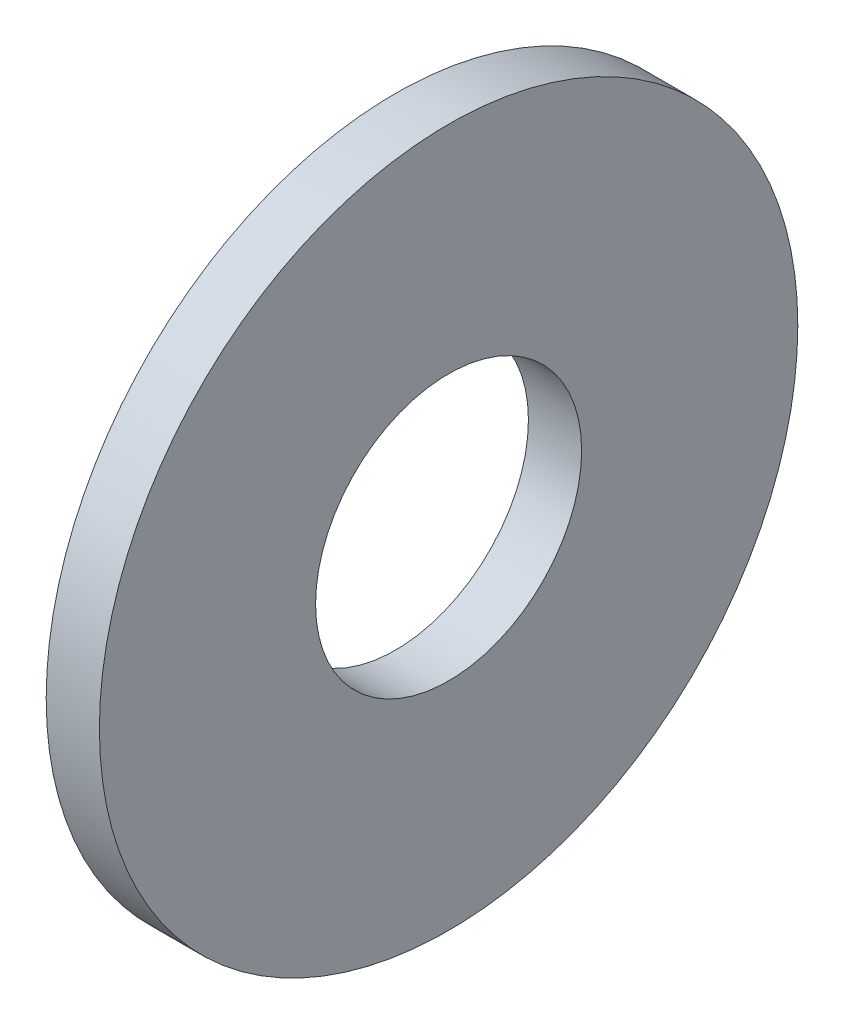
from build123d import *

# Parameters (mm, degrees)
ESQUISSE1_W = 1.6
ESQUISSE1_H = 6.5


with BuildPart() as part:
    # Esquisse1 → R_volution1 (revolve)
    with BuildSketch(Plane(origin=(0, 0, 0), x_dir=(-1, 0, 0), z_dir=(0, 0, -1)), mode=Mode.PRIVATE) as r_volution1_sk:
        with Locations((0, 7.25)):
            Rectangle(ESQUISSE1_W, ESQUISSE1_H)
    revolve(r_volution1_sk.sketch.rotate(Axis((0.8, 0, 0), (-1, 0, 0)), 270), axis=Axis((0.8, 0, 0), (-1, 0, 0)))


solid = part.part
